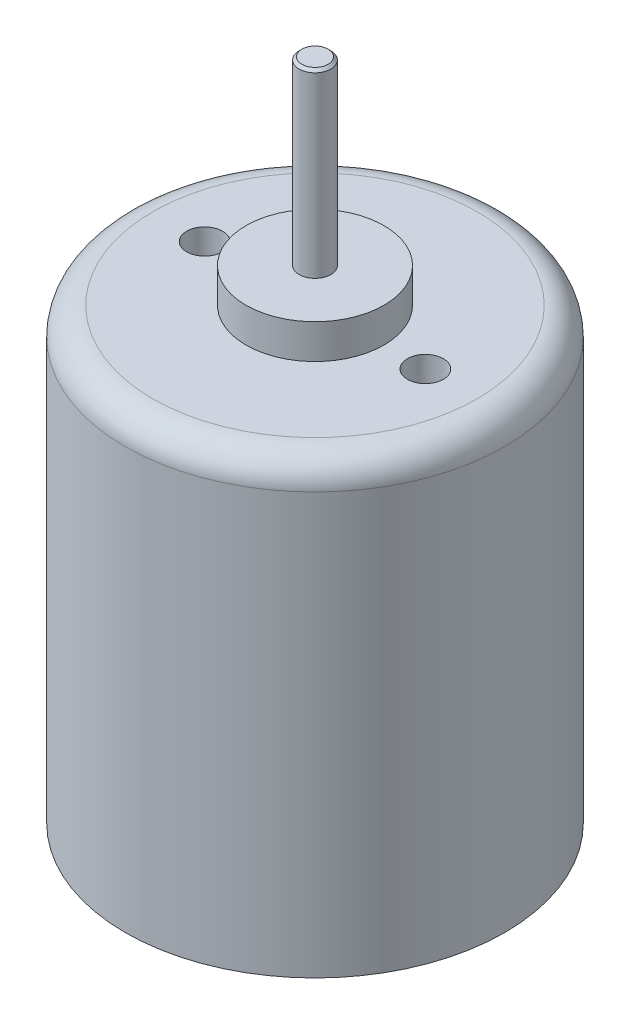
from build123d import *

# Parameters (mm, degrees)
SKETCH1_R            = 13.75
BODY_DEPTH           = 32.5
SKETCH2_R            = 1.15
SHAFT_DEPTH          = 51
SKETCH3_R            = 5
REAR_BUSHING_DEPTH   = 2.5
SKETCH4_R            = 5
FRONT_BUSHING_DEPTH  = 2.5
SKETCH5_R            = 1.3
MOUNTING_HOLES_DEPTH = 5
BODY_FILLET_R        = 2
SHAFT_CHAMFERS_SIZE  = 0.2


with BuildPart() as part:
    # Sketch1 → body (new body)
    with BuildSketch(Plane(origin=(0, 0, 0), x_dir=(1, 0, 0), z_dir=(0, 1, 0))):
        with Locations(Location((0, 0, 0), (0, 0, 270))):
            Circle(SKETCH1_R)
    extrude(amount=BODY_DEPTH)

    # Sketch5 → mounting holes (cut)
    with BuildSketch(Plane(origin=(0, 32.5, 0), x_dir=(1, 0, 0), z_dir=(0, 1, 0))):
        with Locations(Location((-8, 0, 0), (0, 0, 270))):
            Circle(SKETCH5_R)
        with Locations(Location((8, 0, 0), (0, 0, 90))):
            Circle(SKETCH5_R)
    extrude(amount=-MOUNTING_HOLES_DEPTH, mode=Mode.SUBTRACT)

    # body fillet
    body_fillet_edges = [part.edges().sort_by_distance(p)[0] for p in [
        (0, 32.5, -13.75),
    ]]
    fillet(body_fillet_edges, radius=BODY_FILLET_R)


with BuildPart() as body_2:
    # Sketch2 → shaft (new body)
    with BuildSketch(Plane(origin=(0, 48.1, 0), x_dir=(-1, 0, 0), z_dir=(0, 1, 0))):
        with Locations(Location((0, 0, 0), (0, 0, 90))):
            Circle(SKETCH2_R)
    extrude(amount=-SHAFT_DEPTH)

    # shaft chamfers
    shaft_chamfers_edges = [body_2.edges().sort_by_distance(p)[0] for p in [
        (0, 48.1, -1.15),
        (0, -2.9, -1.15),
    ]]
    chamfer(shaft_chamfers_edges, length=SHAFT_CHAMFERS_SIZE)


with BuildPart() as body_3:
    # Sketch3 → rear bushing (new body)
    with BuildSketch(Plane.XZ):
        with Locations(Location((0, 0, 0), (0, 0, 270))):
            Circle(SKETCH3_R)
    extrude(amount=REAR_BUSHING_DEPTH)


with BuildPart() as body_4:
    # Sketch4 → front bushing (new body)
    with BuildSketch(Plane(origin=(0, 32.5, 0), x_dir=(1, 0, 0), z_dir=(0, 1, 0))):
        with Locations(Location((0, 0, 0), (0, 0, 270))):
            Circle(SKETCH4_R)
    extrude(amount=FRONT_BUSHING_DEPTH)


solid = Compound([part.part, body_2.part, body_3.part, body_4.part])
